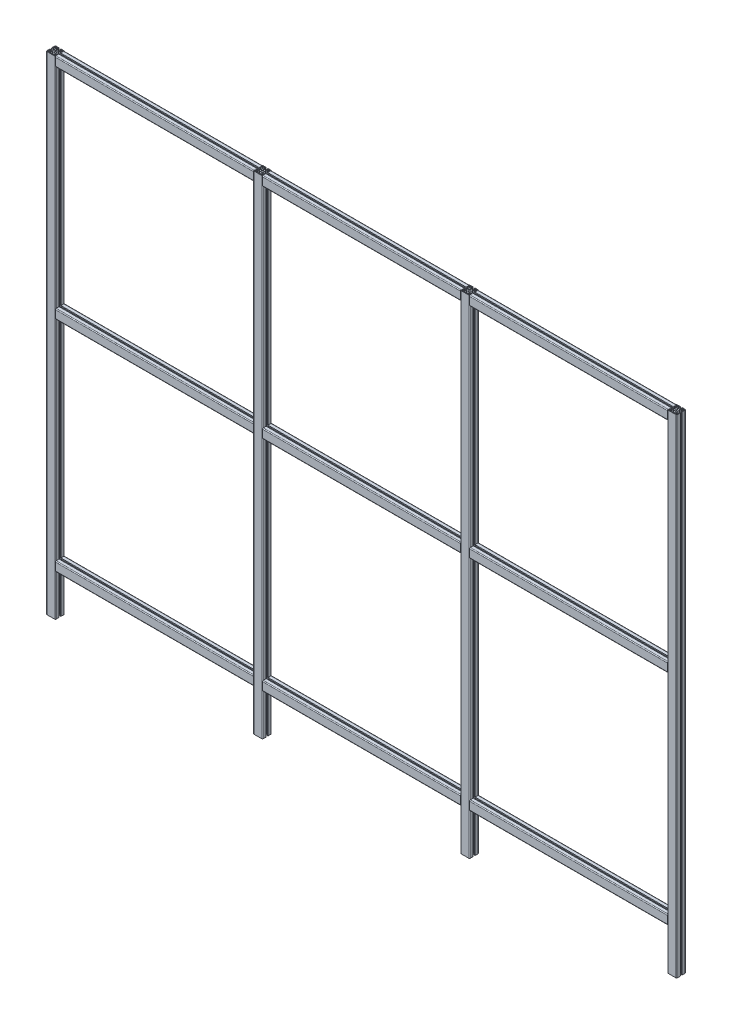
from build123d import *

# Parameters (mm, degrees)
CLOSED_PROFILES_40_LIGHT_SP5510N_PROFILE_DEPTH      = 2100
CLOSED_PROFILES_40_LIGHT_SP5510N_PROFILE_DEPTH_BACK = 20
SKETCH13_R                                          = 3.4
SKETCH13_ON_SEGMENT_2_R                             = 3.4
CLOSED_PROFILES_40_LIGHT_SP5510N_PRO_2_DEPTH        = 2120
SKETCH13_ON_SEGMENT_3_R                             = 3.4
CLOSED_PROFILES_40_LIGHT_SP5510N_PRO_3_DEPTH        = 2120
SKETCH13_ON_SEGMENT_4_R                             = 3.4
CLOSED_PROFILES_40_LIGHT_SP5510N_PRO_4_DEPTH        = 2120
SKETCH13_ON_SEGMENT_5_R                             = 3.4
CLOSED_PROFILES_40_LIGHT_SP5510N_PRO_5_DEPTH        = 902
SKETCH13_ON_SEGMENT_6_R                             = 3.4
CLOSED_PROFILES_40_LIGHT_SP5510N_PRO_7_DEPTH        = 902
SKETCH13_ON_SEGMENT_7_R                             = 3.4
CLOSED_PROFILES_40_LIGHT_SP5510N_PRO_9_DEPTH        = 902
SKETCH13_ON_SEGMENT_8_R                             = 3.4
CLOSED_PROFILES_40_LIGHT_SP5510N_PRO_11_DEPTH       = 902
SKETCH13_ON_SEGMENT_9_R                             = 3.4
CLOSED_PROFILES_40_LIGHT_SP5510N_PRO_14_DEPTH       = 902
SKETCH13_ON_SEGMENT_10_R                            = 3.4
CLOSED_PROFILES_40_LIGHT_SP5510N_PRO_17_DEPTH       = 902
SKETCH13_ON_SEGMENT_11_R                            = 3.4
CLOSED_PROFILES_40_LIGHT_SP5510N_PRO_20_DEPTH       = 902
SKETCH13_ON_SEGMENT_12_R                            = 3.4
CLOSED_PROFILES_40_LIGHT_SP5510N_PRO_23_DEPTH       = 902
SKETCH13_ON_SEGMENT_13_R                            = 3.4
CLOSED_PROFILES_40_LIGHT_SP5510N_PRO_26_DEPTH       = 902


with BuildPart() as part:
    # Sketch13 → Closed profiles 40 light SP5510N PROFILE (new, two sides: drawn at the far end of the back side and taken through both)
    with BuildSketch(Plane(origin=(-1350, 0, 0), x_dir=(0, 0, -1), z_dir=(0, -1, 0)).offset(-CLOSED_PROFILES_40_LIGHT_SP5510N_PROFILE_DEPTH_BACK)):
        with BuildLine():
            Line((15.5, 4.1), (20, 4.1))
            Line((20, 4.1), (20, 16.5))
            ThreePointArc((20, 16.5), (18.974873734, 18.974873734), (16.5, 20))
            Line((16.5, 20), (4.1, 20))
            Line((4.1, 20), (4.1, 15.5))
            Line((4.1, 15.5), (6, 15.5))
            Line((6, 15.5), (6, 18))
            Line((6, 18), (10, 18))
            Line((10, 18), (10, 12.121))
            Line((10, 12.121), (5.479, 7.6))
            Line((5.479, 7.6), (-5.479, 7.6))
            Line((-5.479, 7.6), (-10, 12.121))
            Line((-10, 12.121), (-10, 18))
            Line((-10, 18), (-6, 18))
            Line((-6, 18), (-6, 15.5))
            Line((-6, 15.5), (-4.1, 15.5))
            Line((-4.1, 15.5), (-4.1, 20))
            Line((-4.1, 20), (-16.5, 20))
            ThreePointArc((-16.5, 20), (-18.974873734, 18.974873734), (-20, 16.5))
            Line((-20, 16.5), (-20, -16.5))
            ThreePointArc((-20, -16.5), (-18.974873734, -18.974873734), (-16.5, -20))
            Line((-16.5, -20), (-4.1, -20))
            Line((-4.1, -20), (-4.1, -15.5))
            Line((-4.1, -15.5), (-6, -15.5))
            Line((-6, -15.5), (-6, -18))
            Line((-6, -18), (-10, -18))
            Line((-10, -18), (-10, -12.121))
            Line((-10, -12.121), (-5.479, -7.6))
            Line((-5.479, -7.6), (5.479, -7.6))
            Line((5.479, -7.6), (10, -12.121))
            Line((10, -12.121), (10, -18))
            Line((10, -18), (6, -18))
            Line((6, -18), (6, -15.5))
            Line((6, -15.5), (4.1, -15.5))
            Line((4.1, -15.5), (4.1, -20))
            Line((4.1, -20), (16.5, -20))
            ThreePointArc((16.5, -20), (18.974873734, -18.974873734), (20, -16.5))
            Line((20, -16.5), (20, -4.1))
            Line((20, -4.1), (15.5, -4.1))
            Line((15.5, -4.1), (15.5, -6))
            Line((15.5, -6), (18, -6))
            Line((18, -6), (18, -10))
            Line((18, -10), (12.121, -10))
            Line((12.121, -10), (7.6, -5.479))
            Line((7.6, -5.479), (7.6, 5.479))
            Line((7.6, 5.479), (12.121, 10))
            Line((12.121, 10), (18, 10))
            Line((18, 10), (18, 6))
            Line((18, 6), (15.5, 6))
            Line((15.5, 6), (15.5, 4.1))
        make_face()
        Circle(SKETCH13_R, mode=Mode.SUBTRACT)
        with BuildLine():
            Line((17.1, -11.7), (12.7, -11.7))
            ThreePointArc((12.7, -11.7), (11.992893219, -11.992893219), (11.7, -12.7))
            Line((11.7, -12.7), (11.7, -17.1))
            ThreePointArc((11.7, -17.1), (11.992893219, -17.807106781), (12.7, -18.1))
            Line((12.7, -18.1), (15.6, -18.1))
            ThreePointArc((15.6, -18.1), (17.367766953, -17.367766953), (18.1, -15.6))
            Line((18.1, -15.6), (18.1, -12.7))
            ThreePointArc((18.1, -12.7), (17.807106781, -11.992893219), (17.1, -11.7))
        make_face(mode=Mode.SUBTRACT)
        with BuildLine():
            Line((-11.7, -17.1), (-11.7, -12.7))
            ThreePointArc((-11.7, -12.7), (-11.992893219, -11.992893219), (-12.7, -11.7))
            Line((-12.7, -11.7), (-17.1, -11.7))
            ThreePointArc((-17.1, -11.7), (-17.807106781, -11.992893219), (-18.1, -12.7))
            Line((-18.1, -12.7), (-18.1, -15.6))
            ThreePointArc((-18.1, -15.6), (-17.367766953, -17.367766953), (-15.6, -18.1))
            Line((-15.6, -18.1), (-12.7, -18.1))
            ThreePointArc((-12.7, -18.1), (-11.992893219, -17.807106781), (-11.7, -17.1))
        make_face(mode=Mode.SUBTRACT)
        with BuildLine():
            Line((-17.1, 11.7), (-12.7, 11.7))
            ThreePointArc((-12.7, 11.7), (-11.992893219, 11.992893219), (-11.7, 12.7))
            Line((-11.7, 12.7), (-11.7, 17.1))
            ThreePointArc((-11.7, 17.1), (-11.992893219, 17.807106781), (-12.7, 18.1))
            Line((-12.7, 18.1), (-15.6, 18.1))
            ThreePointArc((-15.6, 18.1), (-17.367766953, 17.367766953), (-18.1, 15.6))
            Line((-18.1, 15.6), (-18.1, 12.7))
            ThreePointArc((-18.1, 12.7), (-17.807106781, 11.992893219), (-17.1, 11.7))
        make_face(mode=Mode.SUBTRACT)
        with BuildLine():
            Line((11.7, 17.1), (11.7, 12.7))
            ThreePointArc((11.7, 12.7), (11.992893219, 11.992893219), (12.7, 11.7))
            Line((12.7, 11.7), (17.1, 11.7))
            ThreePointArc((17.1, 11.7), (17.807106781, 11.992893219), (18.1, 12.7))
            Line((18.1, 12.7), (18.1, 15.6))
            ThreePointArc((18.1, 15.6), (17.367766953, 17.367766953), (15.6, 18.1))
            Line((15.6, 18.1), (12.7, 18.1))
            ThreePointArc((12.7, 18.1), (11.992893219, 17.807106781), (11.7, 17.1))
        make_face(mode=Mode.SUBTRACT)
        Polygon((-18, -4.1), (-15.5, -4.1), (-15.5, -6), (-18, -6), (-18, -10), (-12.121, -10), (-7.6, -5.479), (-7.6, 5.479), (-12.121, 10), (-18, 10), (-18, 6), (-15.5, 6), (-15.5, 4.1), (-18, 4.1), align=None, mode=Mode.SUBTRACT)
    extrude(amount=CLOSED_PROFILES_40_LIGHT_SP5510N_PROFILE_DEPTH + CLOSED_PROFILES_40_LIGHT_SP5510N_PROFILE_DEPTH_BACK)


with BuildPart() as body_2:
    # Sketch13 on segment 2 (on carried to segment 2) → Closed profiles 40 light SP5510N PRO 2 (new body)
    with BuildSketch(Plane(origin=(-450, 20, 0), x_dir=(0, 0, -1), z_dir=(0, -1, 0))):
        with BuildLine():
            Line((15.5, 4.1), (20, 4.1))
            Line((20, 4.1), (20, 16.5))
            ThreePointArc((20, 16.5), (18.974873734, 18.974873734), (16.5, 20))
            Line((16.5, 20), (4.1, 20))
            Line((4.1, 20), (4.1, 15.5))
            Line((4.1, 15.5), (6, 15.5))
            Line((6, 15.5), (6, 18))
            Line((6, 18), (10, 18))
            Line((10, 18), (10, 12.121))
            Line((10, 12.121), (5.479, 7.6))
            Line((5.479, 7.6), (-5.479, 7.6))
            Line((-5.479, 7.6), (-10, 12.121))
            Line((-10, 12.121), (-10, 18))
            Line((-10, 18), (-6, 18))
            Line((-6, 18), (-6, 15.5))
            Line((-6, 15.5), (-4.1, 15.5))
            Line((-4.1, 15.5), (-4.1, 20))
            Line((-4.1, 20), (-16.5, 20))
            ThreePointArc((-16.5, 20), (-18.974873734, 18.974873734), (-20, 16.5))
            Line((-20, 16.5), (-20, -16.5))
            ThreePointArc((-20, -16.5), (-18.974873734, -18.974873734), (-16.5, -20))
            Line((-16.5, -20), (-4.1, -20))
            Line((-4.1, -20), (-4.1, -15.5))
            Line((-4.1, -15.5), (-6, -15.5))
            Line((-6, -15.5), (-6, -18))
            Line((-6, -18), (-10, -18))
            Line((-10, -18), (-10, -12.121))
            Line((-10, -12.121), (-5.479, -7.6))
            Line((-5.479, -7.6), (5.479, -7.6))
            Line((5.479, -7.6), (10, -12.121))
            Line((10, -12.121), (10, -18))
            Line((10, -18), (6, -18))
            Line((6, -18), (6, -15.5))
            Line((6, -15.5), (4.1, -15.5))
            Line((4.1, -15.5), (4.1, -20))
            Line((4.1, -20), (16.5, -20))
            ThreePointArc((16.5, -20), (18.974873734, -18.974873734), (20, -16.5))
            Line((20, -16.5), (20, -4.1))
            Line((20, -4.1), (15.5, -4.1))
            Line((15.5, -4.1), (15.5, -6))
            Line((15.5, -6), (18, -6))
            Line((18, -6), (18, -10))
            Line((18, -10), (12.121, -10))
            Line((12.121, -10), (7.6, -5.479))
            Line((7.6, -5.479), (7.6, 5.479))
            Line((7.6, 5.479), (12.121, 10))
            Line((12.121, 10), (18, 10))
            Line((18, 10), (18, 6))
            Line((18, 6), (15.5, 6))
            Line((15.5, 6), (15.5, 4.1))
        make_face()
        Circle(SKETCH13_ON_SEGMENT_2_R, mode=Mode.SUBTRACT)
        with BuildLine():
            Line((17.1, -11.7), (12.7, -11.7))
            ThreePointArc((12.7, -11.7), (11.992893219, -11.992893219), (11.7, -12.7))
            Line((11.7, -12.7), (11.7, -17.1))
            ThreePointArc((11.7, -17.1), (11.992893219, -17.807106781), (12.7, -18.1))
            Line((12.7, -18.1), (15.6, -18.1))
            ThreePointArc((15.6, -18.1), (17.367766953, -17.367766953), (18.1, -15.6))
            Line((18.1, -15.6), (18.1, -12.7))
            ThreePointArc((18.1, -12.7), (17.807106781, -11.992893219), (17.1, -11.7))
        make_face(mode=Mode.SUBTRACT)
        with BuildLine():
            Line((-11.7, -17.1), (-11.7, -12.7))
            ThreePointArc((-11.7, -12.7), (-11.992893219, -11.992893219), (-12.7, -11.7))
            Line((-12.7, -11.7), (-17.1, -11.7))
            ThreePointArc((-17.1, -11.7), (-17.807106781, -11.992893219), (-18.1, -12.7))
            Line((-18.1, -12.7), (-18.1, -15.6))
            ThreePointArc((-18.1, -15.6), (-17.367766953, -17.367766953), (-15.6, -18.1))
            Line((-15.6, -18.1), (-12.7, -18.1))
            ThreePointArc((-12.7, -18.1), (-11.992893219, -17.807106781), (-11.7, -17.1))
        make_face(mode=Mode.SUBTRACT)
        with BuildLine():
            Line((-17.1, 11.7), (-12.7, 11.7))
            ThreePointArc((-12.7, 11.7), (-11.992893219, 11.992893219), (-11.7, 12.7))
            Line((-11.7, 12.7), (-11.7, 17.1))
            ThreePointArc((-11.7, 17.1), (-11.992893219, 17.807106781), (-12.7, 18.1))
            Line((-12.7, 18.1), (-15.6, 18.1))
            ThreePointArc((-15.6, 18.1), (-17.367766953, 17.367766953), (-18.1, 15.6))
            Line((-18.1, 15.6), (-18.1, 12.7))
            ThreePointArc((-18.1, 12.7), (-17.807106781, 11.992893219), (-17.1, 11.7))
        make_face(mode=Mode.SUBTRACT)
        with BuildLine():
            Line((11.7, 17.1), (11.7, 12.7))
            ThreePointArc((11.7, 12.7), (11.992893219, 11.992893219), (12.7, 11.7))
            Line((12.7, 11.7), (17.1, 11.7))
            ThreePointArc((17.1, 11.7), (17.807106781, 11.992893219), (18.1, 12.7))
            Line((18.1, 12.7), (18.1, 15.6))
            ThreePointArc((18.1, 15.6), (17.367766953, 17.367766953), (15.6, 18.1))
            Line((15.6, 18.1), (12.7, 18.1))
            ThreePointArc((12.7, 18.1), (11.992893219, 17.807106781), (11.7, 17.1))
        make_face(mode=Mode.SUBTRACT)
        Polygon((-18, -4.1), (-15.5, -4.1), (-15.5, -6), (-18, -6), (-18, -10), (-12.121, -10), (-7.6, -5.479), (-7.6, 5.479), (-12.121, 10), (-18, 10), (-18, 6), (-15.5, 6), (-15.5, 4.1), (-18, 4.1), align=None, mode=Mode.SUBTRACT)
    extrude(amount=CLOSED_PROFILES_40_LIGHT_SP5510N_PRO_2_DEPTH)


with BuildPart() as body_3:
    # Sketch13 on segment 3 (on carried to segment 3) → Closed profiles 40 light SP5510N PRO 3 (new body)
    with BuildSketch(Plane(origin=(450, 20, 0), x_dir=(0, 0, -1), z_dir=(0, -1, 0))):
        with BuildLine():
            Line((15.5, 4.1), (20, 4.1))
            Line((20, 4.1), (20, 16.5))
            ThreePointArc((20, 16.5), (18.974873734, 18.974873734), (16.5, 20))
            Line((16.5, 20), (4.1, 20))
            Line((4.1, 20), (4.1, 15.5))
            Line((4.1, 15.5), (6, 15.5))
            Line((6, 15.5), (6, 18))
            Line((6, 18), (10, 18))
            Line((10, 18), (10, 12.121))
            Line((10, 12.121), (5.479, 7.6))
            Line((5.479, 7.6), (-5.479, 7.6))
            Line((-5.479, 7.6), (-10, 12.121))
            Line((-10, 12.121), (-10, 18))
            Line((-10, 18), (-6, 18))
            Line((-6, 18), (-6, 15.5))
            Line((-6, 15.5), (-4.1, 15.5))
            Line((-4.1, 15.5), (-4.1, 20))
            Line((-4.1, 20), (-16.5, 20))
            ThreePointArc((-16.5, 20), (-18.974873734, 18.974873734), (-20, 16.5))
            Line((-20, 16.5), (-20, -16.5))
            ThreePointArc((-20, -16.5), (-18.974873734, -18.974873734), (-16.5, -20))
            Line((-16.5, -20), (-4.1, -20))
            Line((-4.1, -20), (-4.1, -15.5))
            Line((-4.1, -15.5), (-6, -15.5))
            Line((-6, -15.5), (-6, -18))
            Line((-6, -18), (-10, -18))
            Line((-10, -18), (-10, -12.121))
            Line((-10, -12.121), (-5.479, -7.6))
            Line((-5.479, -7.6), (5.479, -7.6))
            Line((5.479, -7.6), (10, -12.121))
            Line((10, -12.121), (10, -18))
            Line((10, -18), (6, -18))
            Line((6, -18), (6, -15.5))
            Line((6, -15.5), (4.1, -15.5))
            Line((4.1, -15.5), (4.1, -20))
            Line((4.1, -20), (16.5, -20))
            ThreePointArc((16.5, -20), (18.974873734, -18.974873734), (20, -16.5))
            Line((20, -16.5), (20, -4.1))
            Line((20, -4.1), (15.5, -4.1))
            Line((15.5, -4.1), (15.5, -6))
            Line((15.5, -6), (18, -6))
            Line((18, -6), (18, -10))
            Line((18, -10), (12.121, -10))
            Line((12.121, -10), (7.6, -5.479))
            Line((7.6, -5.479), (7.6, 5.479))
            Line((7.6, 5.479), (12.121, 10))
            Line((12.121, 10), (18, 10))
            Line((18, 10), (18, 6))
            Line((18, 6), (15.5, 6))
            Line((15.5, 6), (15.5, 4.1))
        make_face()
        Circle(SKETCH13_ON_SEGMENT_3_R, mode=Mode.SUBTRACT)
        with BuildLine():
            Line((17.1, -11.7), (12.7, -11.7))
            ThreePointArc((12.7, -11.7), (11.992893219, -11.992893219), (11.7, -12.7))
            Line((11.7, -12.7), (11.7, -17.1))
            ThreePointArc((11.7, -17.1), (11.992893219, -17.807106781), (12.7, -18.1))
            Line((12.7, -18.1), (15.6, -18.1))
            ThreePointArc((15.6, -18.1), (17.367766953, -17.367766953), (18.1, -15.6))
            Line((18.1, -15.6), (18.1, -12.7))
            ThreePointArc((18.1, -12.7), (17.807106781, -11.992893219), (17.1, -11.7))
        make_face(mode=Mode.SUBTRACT)
        with BuildLine():
            Line((-11.7, -17.1), (-11.7, -12.7))
            ThreePointArc((-11.7, -12.7), (-11.992893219, -11.992893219), (-12.7, -11.7))
            Line((-12.7, -11.7), (-17.1, -11.7))
            ThreePointArc((-17.1, -11.7), (-17.807106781, -11.992893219), (-18.1, -12.7))
            Line((-18.1, -12.7), (-18.1, -15.6))
            ThreePointArc((-18.1, -15.6), (-17.367766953, -17.367766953), (-15.6, -18.1))
            Line((-15.6, -18.1), (-12.7, -18.1))
            ThreePointArc((-12.7, -18.1), (-11.992893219, -17.807106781), (-11.7, -17.1))
        make_face(mode=Mode.SUBTRACT)
        with BuildLine():
            Line((-17.1, 11.7), (-12.7, 11.7))
            ThreePointArc((-12.7, 11.7), (-11.992893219, 11.992893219), (-11.7, 12.7))
            Line((-11.7, 12.7), (-11.7, 17.1))
            ThreePointArc((-11.7, 17.1), (-11.992893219, 17.807106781), (-12.7, 18.1))
            Line((-12.7, 18.1), (-15.6, 18.1))
            ThreePointArc((-15.6, 18.1), (-17.367766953, 17.367766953), (-18.1, 15.6))
            Line((-18.1, 15.6), (-18.1, 12.7))
            ThreePointArc((-18.1, 12.7), (-17.807106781, 11.992893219), (-17.1, 11.7))
        make_face(mode=Mode.SUBTRACT)
        with BuildLine():
            Line((11.7, 17.1), (11.7, 12.7))
            ThreePointArc((11.7, 12.7), (11.992893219, 11.992893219), (12.7, 11.7))
            Line((12.7, 11.7), (17.1, 11.7))
            ThreePointArc((17.1, 11.7), (17.807106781, 11.992893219), (18.1, 12.7))
            Line((18.1, 12.7), (18.1, 15.6))
            ThreePointArc((18.1, 15.6), (17.367766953, 17.367766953), (15.6, 18.1))
            Line((15.6, 18.1), (12.7, 18.1))
            ThreePointArc((12.7, 18.1), (11.992893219, 17.807106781), (11.7, 17.1))
        make_face(mode=Mode.SUBTRACT)
        Polygon((-18, -4.1), (-15.5, -4.1), (-15.5, -6), (-18, -6), (-18, -10), (-12.121, -10), (-7.6, -5.479), (-7.6, 5.479), (-12.121, 10), (-18, 10), (-18, 6), (-15.5, 6), (-15.5, 4.1), (-18, 4.1), align=None, mode=Mode.SUBTRACT)
    extrude(amount=CLOSED_PROFILES_40_LIGHT_SP5510N_PRO_3_DEPTH)


with BuildPart() as body_4:
    # Sketch13 on segment 4 (on carried to segment 4) → Closed profiles 40 light SP5510N PRO 4 (new body)
    with BuildSketch(Plane(origin=(1350, 20, 0), x_dir=(0, 0, -1), z_dir=(0, -1, 0))):
        with BuildLine():
            Line((15.5, 4.1), (20, 4.1))
            Line((20, 4.1), (20, 16.5))
            ThreePointArc((20, 16.5), (18.974873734, 18.974873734), (16.5, 20))
            Line((16.5, 20), (4.1, 20))
            Line((4.1, 20), (4.1, 15.5))
            Line((4.1, 15.5), (6, 15.5))
            Line((6, 15.5), (6, 18))
            Line((6, 18), (10, 18))
            Line((10, 18), (10, 12.121))
            Line((10, 12.121), (5.479, 7.6))
            Line((5.479, 7.6), (-5.479, 7.6))
            Line((-5.479, 7.6), (-10, 12.121))
            Line((-10, 12.121), (-10, 18))
            Line((-10, 18), (-6, 18))
            Line((-6, 18), (-6, 15.5))
            Line((-6, 15.5), (-4.1, 15.5))
            Line((-4.1, 15.5), (-4.1, 20))
            Line((-4.1, 20), (-16.5, 20))
            ThreePointArc((-16.5, 20), (-18.974873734, 18.974873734), (-20, 16.5))
            Line((-20, 16.5), (-20, -16.5))
            ThreePointArc((-20, -16.5), (-18.974873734, -18.974873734), (-16.5, -20))
            Line((-16.5, -20), (-4.1, -20))
            Line((-4.1, -20), (-4.1, -15.5))
            Line((-4.1, -15.5), (-6, -15.5))
            Line((-6, -15.5), (-6, -18))
            Line((-6, -18), (-10, -18))
            Line((-10, -18), (-10, -12.121))
            Line((-10, -12.121), (-5.479, -7.6))
            Line((-5.479, -7.6), (5.479, -7.6))
            Line((5.479, -7.6), (10, -12.121))
            Line((10, -12.121), (10, -18))
            Line((10, -18), (6, -18))
            Line((6, -18), (6, -15.5))
            Line((6, -15.5), (4.1, -15.5))
            Line((4.1, -15.5), (4.1, -20))
            Line((4.1, -20), (16.5, -20))
            ThreePointArc((16.5, -20), (18.974873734, -18.974873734), (20, -16.5))
            Line((20, -16.5), (20, -4.1))
            Line((20, -4.1), (15.5, -4.1))
            Line((15.5, -4.1), (15.5, -6))
            Line((15.5, -6), (18, -6))
            Line((18, -6), (18, -10))
            Line((18, -10), (12.121, -10))
            Line((12.121, -10), (7.6, -5.479))
            Line((7.6, -5.479), (7.6, 5.479))
            Line((7.6, 5.479), (12.121, 10))
            Line((12.121, 10), (18, 10))
            Line((18, 10), (18, 6))
            Line((18, 6), (15.5, 6))
            Line((15.5, 6), (15.5, 4.1))
        make_face()
        Circle(SKETCH13_ON_SEGMENT_4_R, mode=Mode.SUBTRACT)
        with BuildLine():
            Line((17.1, -11.7), (12.7, -11.7))
            ThreePointArc((12.7, -11.7), (11.992893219, -11.992893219), (11.7, -12.7))
            Line((11.7, -12.7), (11.7, -17.1))
            ThreePointArc((11.7, -17.1), (11.992893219, -17.807106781), (12.7, -18.1))
            Line((12.7, -18.1), (15.6, -18.1))
            ThreePointArc((15.6, -18.1), (17.367766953, -17.367766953), (18.1, -15.6))
            Line((18.1, -15.6), (18.1, -12.7))
            ThreePointArc((18.1, -12.7), (17.807106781, -11.992893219), (17.1, -11.7))
        make_face(mode=Mode.SUBTRACT)
        with BuildLine():
            Line((-11.7, -17.1), (-11.7, -12.7))
            ThreePointArc((-11.7, -12.7), (-11.992893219, -11.992893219), (-12.7, -11.7))
            Line((-12.7, -11.7), (-17.1, -11.7))
            ThreePointArc((-17.1, -11.7), (-17.807106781, -11.992893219), (-18.1, -12.7))
            Line((-18.1, -12.7), (-18.1, -15.6))
            ThreePointArc((-18.1, -15.6), (-17.367766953, -17.367766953), (-15.6, -18.1))
            Line((-15.6, -18.1), (-12.7, -18.1))
            ThreePointArc((-12.7, -18.1), (-11.992893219, -17.807106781), (-11.7, -17.1))
        make_face(mode=Mode.SUBTRACT)
        with BuildLine():
            Line((-17.1, 11.7), (-12.7, 11.7))
            ThreePointArc((-12.7, 11.7), (-11.992893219, 11.992893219), (-11.7, 12.7))
            Line((-11.7, 12.7), (-11.7, 17.1))
            ThreePointArc((-11.7, 17.1), (-11.992893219, 17.807106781), (-12.7, 18.1))
            Line((-12.7, 18.1), (-15.6, 18.1))
            ThreePointArc((-15.6, 18.1), (-17.367766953, 17.367766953), (-18.1, 15.6))
            Line((-18.1, 15.6), (-18.1, 12.7))
            ThreePointArc((-18.1, 12.7), (-17.807106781, 11.992893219), (-17.1, 11.7))
        make_face(mode=Mode.SUBTRACT)
        with BuildLine():
            Line((11.7, 17.1), (11.7, 12.7))
            ThreePointArc((11.7, 12.7), (11.992893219, 11.992893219), (12.7, 11.7))
            Line((12.7, 11.7), (17.1, 11.7))
            ThreePointArc((17.1, 11.7), (17.807106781, 11.992893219), (18.1, 12.7))
            Line((18.1, 12.7), (18.1, 15.6))
            ThreePointArc((18.1, 15.6), (17.367766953, 17.367766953), (15.6, 18.1))
            Line((15.6, 18.1), (12.7, 18.1))
            ThreePointArc((12.7, 18.1), (11.992893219, 17.807106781), (11.7, 17.1))
        make_face(mode=Mode.SUBTRACT)
        Polygon((-18, -4.1), (-15.5, -4.1), (-15.5, -6), (-18, -6), (-18, -10), (-12.121, -10), (-7.6, -5.479), (-7.6, 5.479), (-12.121, 10), (-18, 10), (-18, 6), (-15.5, 6), (-15.5, 4.1), (-18, 4.1), align=None, mode=Mode.SUBTRACT)
    extrude(amount=CLOSED_PROFILES_40_LIGHT_SP5510N_PRO_4_DEPTH)


with BuildPart() as body_5:
    # Sketch13 on segment 5 (on carried to segment 5) → Closed profiles 40 light SP5510N PRO 5 (new body)
    with BuildSketch(Plane(origin=(-1351, 0, 0), x_dir=(0, 0, -1), z_dir=(1, 0, 0))):
        with BuildLine():
            Line((15.5, 4.1), (20, 4.1))
            Line((20, 4.1), (20, 16.5))
            ThreePointArc((20, 16.5), (18.974873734, 18.974873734), (16.5, 20))
            Line((16.5, 20), (4.1, 20))
            Line((4.1, 20), (4.1, 15.5))
            Line((4.1, 15.5), (6, 15.5))
            Line((6, 15.5), (6, 18))
            Line((6, 18), (10, 18))
            Line((10, 18), (10, 12.121))
            Line((10, 12.121), (5.479, 7.6))
            Line((5.479, 7.6), (-5.479, 7.6))
            Line((-5.479, 7.6), (-10, 12.121))
            Line((-10, 12.121), (-10, 18))
            Line((-10, 18), (-6, 18))
            Line((-6, 18), (-6, 15.5))
            Line((-6, 15.5), (-4.1, 15.5))
            Line((-4.1, 15.5), (-4.1, 20))
            Line((-4.1, 20), (-16.5, 20))
            ThreePointArc((-16.5, 20), (-18.974873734, 18.974873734), (-20, 16.5))
            Line((-20, 16.5), (-20, -16.5))
            ThreePointArc((-20, -16.5), (-18.974873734, -18.974873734), (-16.5, -20))
            Line((-16.5, -20), (-4.1, -20))
            Line((-4.1, -20), (-4.1, -15.5))
            Line((-4.1, -15.5), (-6, -15.5))
            Line((-6, -15.5), (-6, -18))
            Line((-6, -18), (-10, -18))
            Line((-10, -18), (-10, -12.121))
            Line((-10, -12.121), (-5.479, -7.6))
            Line((-5.479, -7.6), (5.479, -7.6))
            Line((5.479, -7.6), (10, -12.121))
            Line((10, -12.121), (10, -18))
            Line((10, -18), (6, -18))
            Line((6, -18), (6, -15.5))
            Line((6, -15.5), (4.1, -15.5))
            Line((4.1, -15.5), (4.1, -20))
            Line((4.1, -20), (16.5, -20))
            ThreePointArc((16.5, -20), (18.974873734, -18.974873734), (20, -16.5))
            Line((20, -16.5), (20, -4.1))
            Line((20, -4.1), (15.5, -4.1))
            Line((15.5, -4.1), (15.5, -6))
            Line((15.5, -6), (18, -6))
            Line((18, -6), (18, -10))
            Line((18, -10), (12.121, -10))
            Line((12.121, -10), (7.6, -5.479))
            Line((7.6, -5.479), (7.6, 5.479))
            Line((7.6, 5.479), (12.121, 10))
            Line((12.121, 10), (18, 10))
            Line((18, 10), (18, 6))
            Line((18, 6), (15.5, 6))
            Line((15.5, 6), (15.5, 4.1))
        make_face()
        Circle(SKETCH13_ON_SEGMENT_5_R, mode=Mode.SUBTRACT)
        with BuildLine():
            Line((17.1, -11.7), (12.7, -11.7))
            ThreePointArc((12.7, -11.7), (11.992893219, -11.992893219), (11.7, -12.7))
            Line((11.7, -12.7), (11.7, -17.1))
            ThreePointArc((11.7, -17.1), (11.992893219, -17.807106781), (12.7, -18.1))
            Line((12.7, -18.1), (15.6, -18.1))
            ThreePointArc((15.6, -18.1), (17.367766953, -17.367766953), (18.1, -15.6))
            Line((18.1, -15.6), (18.1, -12.7))
            ThreePointArc((18.1, -12.7), (17.807106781, -11.992893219), (17.1, -11.7))
        make_face(mode=Mode.SUBTRACT)
        with BuildLine():
            Line((-11.7, -17.1), (-11.7, -12.7))
            ThreePointArc((-11.7, -12.7), (-11.992893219, -11.992893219), (-12.7, -11.7))
            Line((-12.7, -11.7), (-17.1, -11.7))
            ThreePointArc((-17.1, -11.7), (-17.807106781, -11.992893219), (-18.1, -12.7))
            Line((-18.1, -12.7), (-18.1, -15.6))
            ThreePointArc((-18.1, -15.6), (-17.367766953, -17.367766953), (-15.6, -18.1))
            Line((-15.6, -18.1), (-12.7, -18.1))
            ThreePointArc((-12.7, -18.1), (-11.992893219, -17.807106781), (-11.7, -17.1))
        make_face(mode=Mode.SUBTRACT)
        with BuildLine():
            Line((-17.1, 11.7), (-12.7, 11.7))
            ThreePointArc((-12.7, 11.7), (-11.992893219, 11.992893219), (-11.7, 12.7))
            Line((-11.7, 12.7), (-11.7, 17.1))
            ThreePointArc((-11.7, 17.1), (-11.992893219, 17.807106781), (-12.7, 18.1))
            Line((-12.7, 18.1), (-15.6, 18.1))
            ThreePointArc((-15.6, 18.1), (-17.367766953, 17.367766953), (-18.1, 15.6))
            Line((-18.1, 15.6), (-18.1, 12.7))
            ThreePointArc((-18.1, 12.7), (-17.807106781, 11.992893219), (-17.1, 11.7))
        make_face(mode=Mode.SUBTRACT)
        with BuildLine():
            Line((11.7, 17.1), (11.7, 12.7))
            ThreePointArc((11.7, 12.7), (11.992893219, 11.992893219), (12.7, 11.7))
            Line((12.7, 11.7), (17.1, 11.7))
            ThreePointArc((17.1, 11.7), (17.807106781, 11.992893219), (18.1, 12.7))
            Line((18.1, 12.7), (18.1, 15.6))
            ThreePointArc((18.1, 15.6), (17.367766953, 17.367766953), (15.6, 18.1))
            Line((15.6, 18.1), (12.7, 18.1))
            ThreePointArc((12.7, 18.1), (11.992893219, 17.807106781), (11.7, 17.1))
        make_face(mode=Mode.SUBTRACT)
        Polygon((-18, -4.1), (-15.5, -4.1), (-15.5, -6), (-18, -6), (-18, -10), (-12.121, -10), (-7.6, -5.479), (-7.6, 5.479), (-12.121, 10), (-18, 10), (-18, 6), (-15.5, 6), (-15.5, 4.1), (-18, 4.1), align=None, mode=Mode.SUBTRACT)
    extrude(amount=CLOSED_PROFILES_40_LIGHT_SP5510N_PRO_5_DEPTH)

    # Closed profiles 40 light SP5510N PRO 5 e
    split(bisect_by=Plane.YZ.offset(-1330), keep=Keep.TOP)

    # Closed profiles 40 light SP5510N PRO 6
    split(bisect_by=Plane(origin=(-470, 0, 0), x_dir=(0, -1, 0), z_dir=(-1, 0, 0)), keep=Keep.TOP)


with BuildPart() as body_6:
    # Sketch13 on segment 6 (on carried to segment 6) → Closed profiles 40 light SP5510N PRO 7 (new body)
    with BuildSketch(Plane(origin=(-1351, -1900, 0), x_dir=(0, 0, -1), z_dir=(1, 0, 0))):
        with BuildLine():
            Line((15.5, 4.1), (20, 4.1))
            Line((20, 4.1), (20, 16.5))
            ThreePointArc((20, 16.5), (18.974873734, 18.974873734), (16.5, 20))
            Line((16.5, 20), (4.1, 20))
            Line((4.1, 20), (4.1, 15.5))
            Line((4.1, 15.5), (6, 15.5))
            Line((6, 15.5), (6, 18))
            Line((6, 18), (10, 18))
            Line((10, 18), (10, 12.121))
            Line((10, 12.121), (5.479, 7.6))
            Line((5.479, 7.6), (-5.479, 7.6))
            Line((-5.479, 7.6), (-10, 12.121))
            Line((-10, 12.121), (-10, 18))
            Line((-10, 18), (-6, 18))
            Line((-6, 18), (-6, 15.5))
            Line((-6, 15.5), (-4.1, 15.5))
            Line((-4.1, 15.5), (-4.1, 20))
            Line((-4.1, 20), (-16.5, 20))
            ThreePointArc((-16.5, 20), (-18.974873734, 18.974873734), (-20, 16.5))
            Line((-20, 16.5), (-20, -16.5))
            ThreePointArc((-20, -16.5), (-18.974873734, -18.974873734), (-16.5, -20))
            Line((-16.5, -20), (-4.1, -20))
            Line((-4.1, -20), (-4.1, -15.5))
            Line((-4.1, -15.5), (-6, -15.5))
            Line((-6, -15.5), (-6, -18))
            Line((-6, -18), (-10, -18))
            Line((-10, -18), (-10, -12.121))
            Line((-10, -12.121), (-5.479, -7.6))
            Line((-5.479, -7.6), (5.479, -7.6))
            Line((5.479, -7.6), (10, -12.121))
            Line((10, -12.121), (10, -18))
            Line((10, -18), (6, -18))
            Line((6, -18), (6, -15.5))
            Line((6, -15.5), (4.1, -15.5))
            Line((4.1, -15.5), (4.1, -20))
            Line((4.1, -20), (16.5, -20))
            ThreePointArc((16.5, -20), (18.974873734, -18.974873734), (20, -16.5))
            Line((20, -16.5), (20, -4.1))
            Line((20, -4.1), (15.5, -4.1))
            Line((15.5, -4.1), (15.5, -6))
            Line((15.5, -6), (18, -6))
            Line((18, -6), (18, -10))
            Line((18, -10), (12.121, -10))
            Line((12.121, -10), (7.6, -5.479))
            Line((7.6, -5.479), (7.6, 5.479))
            Line((7.6, 5.479), (12.121, 10))
            Line((12.121, 10), (18, 10))
            Line((18, 10), (18, 6))
            Line((18, 6), (15.5, 6))
            Line((15.5, 6), (15.5, 4.1))
        make_face()
        Circle(SKETCH13_ON_SEGMENT_6_R, mode=Mode.SUBTRACT)
        with BuildLine():
            Line((17.1, -11.7), (12.7, -11.7))
            ThreePointArc((12.7, -11.7), (11.992893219, -11.992893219), (11.7, -12.7))
            Line((11.7, -12.7), (11.7, -17.1))
            ThreePointArc((11.7, -17.1), (11.992893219, -17.807106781), (12.7, -18.1))
            Line((12.7, -18.1), (15.6, -18.1))
            ThreePointArc((15.6, -18.1), (17.367766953, -17.367766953), (18.1, -15.6))
            Line((18.1, -15.6), (18.1, -12.7))
            ThreePointArc((18.1, -12.7), (17.807106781, -11.992893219), (17.1, -11.7))
        make_face(mode=Mode.SUBTRACT)
        with BuildLine():
            Line((-11.7, -17.1), (-11.7, -12.7))
            ThreePointArc((-11.7, -12.7), (-11.992893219, -11.992893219), (-12.7, -11.7))
            Line((-12.7, -11.7), (-17.1, -11.7))
            ThreePointArc((-17.1, -11.7), (-17.807106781, -11.992893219), (-18.1, -12.7))
            Line((-18.1, -12.7), (-18.1, -15.6))
            ThreePointArc((-18.1, -15.6), (-17.367766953, -17.367766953), (-15.6, -18.1))
            Line((-15.6, -18.1), (-12.7, -18.1))
            ThreePointArc((-12.7, -18.1), (-11.992893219, -17.807106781), (-11.7, -17.1))
        make_face(mode=Mode.SUBTRACT)
        with BuildLine():
            Line((-17.1, 11.7), (-12.7, 11.7))
            ThreePointArc((-12.7, 11.7), (-11.992893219, 11.992893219), (-11.7, 12.7))
            Line((-11.7, 12.7), (-11.7, 17.1))
            ThreePointArc((-11.7, 17.1), (-11.992893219, 17.807106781), (-12.7, 18.1))
            Line((-12.7, 18.1), (-15.6, 18.1))
            ThreePointArc((-15.6, 18.1), (-17.367766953, 17.367766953), (-18.1, 15.6))
            Line((-18.1, 15.6), (-18.1, 12.7))
            ThreePointArc((-18.1, 12.7), (-17.807106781, 11.992893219), (-17.1, 11.7))
        make_face(mode=Mode.SUBTRACT)
        with BuildLine():
            Line((11.7, 17.1), (11.7, 12.7))
            ThreePointArc((11.7, 12.7), (11.992893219, 11.992893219), (12.7, 11.7))
            Line((12.7, 11.7), (17.1, 11.7))
            ThreePointArc((17.1, 11.7), (17.807106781, 11.992893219), (18.1, 12.7))
            Line((18.1, 12.7), (18.1, 15.6))
            ThreePointArc((18.1, 15.6), (17.367766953, 17.367766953), (15.6, 18.1))
            Line((15.6, 18.1), (12.7, 18.1))
            ThreePointArc((12.7, 18.1), (11.992893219, 17.807106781), (11.7, 17.1))
        make_face(mode=Mode.SUBTRACT)
        Polygon((-18, -4.1), (-15.5, -4.1), (-15.5, -6), (-18, -6), (-18, -10), (-12.121, -10), (-7.6, -5.479), (-7.6, 5.479), (-12.121, 10), (-18, 10), (-18, 6), (-15.5, 6), (-15.5, 4.1), (-18, 4.1), align=None, mode=Mode.SUBTRACT)
    extrude(amount=CLOSED_PROFILES_40_LIGHT_SP5510N_PRO_7_DEPTH)

    # Closed profiles 40 light SP5510N PRO 7 e
    split(bisect_by=Plane(origin=(-1330, -1900, 0), x_dir=(0, 1, 0), z_dir=(1, 0, 0)), keep=Keep.TOP)

    # Closed profiles 40 light SP5510N PRO 8
    split(bisect_by=Plane(origin=(-470, -1900, 0), x_dir=(0, -1, 0), z_dir=(-1, 0, 0)), keep=Keep.TOP)


with BuildPart() as body_7:
    # Sketch13 on segment 7 (on carried to segment 7) → Closed profiles 40 light SP5510N PRO 9 (new body)
    with BuildSketch(Plane(origin=(-451, -1900, 0), x_dir=(0, 0, -1), z_dir=(1, 0, 0))):
        with BuildLine():
            Line((15.5, 4.1), (20, 4.1))
            Line((20, 4.1), (20, 16.5))
            ThreePointArc((20, 16.5), (18.974873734, 18.974873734), (16.5, 20))
            Line((16.5, 20), (4.1, 20))
            Line((4.1, 20), (4.1, 15.5))
            Line((4.1, 15.5), (6, 15.5))
            Line((6, 15.5), (6, 18))
            Line((6, 18), (10, 18))
            Line((10, 18), (10, 12.121))
            Line((10, 12.121), (5.479, 7.6))
            Line((5.479, 7.6), (-5.479, 7.6))
            Line((-5.479, 7.6), (-10, 12.121))
            Line((-10, 12.121), (-10, 18))
            Line((-10, 18), (-6, 18))
            Line((-6, 18), (-6, 15.5))
            Line((-6, 15.5), (-4.1, 15.5))
            Line((-4.1, 15.5), (-4.1, 20))
            Line((-4.1, 20), (-16.5, 20))
            ThreePointArc((-16.5, 20), (-18.974873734, 18.974873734), (-20, 16.5))
            Line((-20, 16.5), (-20, -16.5))
            ThreePointArc((-20, -16.5), (-18.974873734, -18.974873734), (-16.5, -20))
            Line((-16.5, -20), (-4.1, -20))
            Line((-4.1, -20), (-4.1, -15.5))
            Line((-4.1, -15.5), (-6, -15.5))
            Line((-6, -15.5), (-6, -18))
            Line((-6, -18), (-10, -18))
            Line((-10, -18), (-10, -12.121))
            Line((-10, -12.121), (-5.479, -7.6))
            Line((-5.479, -7.6), (5.479, -7.6))
            Line((5.479, -7.6), (10, -12.121))
            Line((10, -12.121), (10, -18))
            Line((10, -18), (6, -18))
            Line((6, -18), (6, -15.5))
            Line((6, -15.5), (4.1, -15.5))
            Line((4.1, -15.5), (4.1, -20))
            Line((4.1, -20), (16.5, -20))
            ThreePointArc((16.5, -20), (18.974873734, -18.974873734), (20, -16.5))
            Line((20, -16.5), (20, -4.1))
            Line((20, -4.1), (15.5, -4.1))
            Line((15.5, -4.1), (15.5, -6))
            Line((15.5, -6), (18, -6))
            Line((18, -6), (18, -10))
            Line((18, -10), (12.121, -10))
            Line((12.121, -10), (7.6, -5.479))
            Line((7.6, -5.479), (7.6, 5.479))
            Line((7.6, 5.479), (12.121, 10))
            Line((12.121, 10), (18, 10))
            Line((18, 10), (18, 6))
            Line((18, 6), (15.5, 6))
            Line((15.5, 6), (15.5, 4.1))
        make_face()
        Circle(SKETCH13_ON_SEGMENT_7_R, mode=Mode.SUBTRACT)
        with BuildLine():
            Line((17.1, -11.7), (12.7, -11.7))
            ThreePointArc((12.7, -11.7), (11.992893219, -11.992893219), (11.7, -12.7))
            Line((11.7, -12.7), (11.7, -17.1))
            ThreePointArc((11.7, -17.1), (11.992893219, -17.807106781), (12.7, -18.1))
            Line((12.7, -18.1), (15.6, -18.1))
            ThreePointArc((15.6, -18.1), (17.367766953, -17.367766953), (18.1, -15.6))
            Line((18.1, -15.6), (18.1, -12.7))
            ThreePointArc((18.1, -12.7), (17.807106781, -11.992893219), (17.1, -11.7))
        make_face(mode=Mode.SUBTRACT)
        with BuildLine():
            Line((-11.7, -17.1), (-11.7, -12.7))
            ThreePointArc((-11.7, -12.7), (-11.992893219, -11.992893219), (-12.7, -11.7))
            Line((-12.7, -11.7), (-17.1, -11.7))
            ThreePointArc((-17.1, -11.7), (-17.807106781, -11.992893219), (-18.1, -12.7))
            Line((-18.1, -12.7), (-18.1, -15.6))
            ThreePointArc((-18.1, -15.6), (-17.367766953, -17.367766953), (-15.6, -18.1))
            Line((-15.6, -18.1), (-12.7, -18.1))
            ThreePointArc((-12.7, -18.1), (-11.992893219, -17.807106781), (-11.7, -17.1))
        make_face(mode=Mode.SUBTRACT)
        with BuildLine():
            Line((-17.1, 11.7), (-12.7, 11.7))
            ThreePointArc((-12.7, 11.7), (-11.992893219, 11.992893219), (-11.7, 12.7))
            Line((-11.7, 12.7), (-11.7, 17.1))
            ThreePointArc((-11.7, 17.1), (-11.992893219, 17.807106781), (-12.7, 18.1))
            Line((-12.7, 18.1), (-15.6, 18.1))
            ThreePointArc((-15.6, 18.1), (-17.367766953, 17.367766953), (-18.1, 15.6))
            Line((-18.1, 15.6), (-18.1, 12.7))
            ThreePointArc((-18.1, 12.7), (-17.807106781, 11.992893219), (-17.1, 11.7))
        make_face(mode=Mode.SUBTRACT)
        with BuildLine():
            Line((11.7, 17.1), (11.7, 12.7))
            ThreePointArc((11.7, 12.7), (11.992893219, 11.992893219), (12.7, 11.7))
            Line((12.7, 11.7), (17.1, 11.7))
            ThreePointArc((17.1, 11.7), (17.807106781, 11.992893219), (18.1, 12.7))
            Line((18.1, 12.7), (18.1, 15.6))
            ThreePointArc((18.1, 15.6), (17.367766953, 17.367766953), (15.6, 18.1))
            Line((15.6, 18.1), (12.7, 18.1))
            ThreePointArc((12.7, 18.1), (11.992893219, 17.807106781), (11.7, 17.1))
        make_face(mode=Mode.SUBTRACT)
        Polygon((-18, -4.1), (-15.5, -4.1), (-15.5, -6), (-18, -6), (-18, -10), (-12.121, -10), (-7.6, -5.479), (-7.6, 5.479), (-12.121, 10), (-18, 10), (-18, 6), (-15.5, 6), (-15.5, 4.1), (-18, 4.1), align=None, mode=Mode.SUBTRACT)
    extrude(amount=CLOSED_PROFILES_40_LIGHT_SP5510N_PRO_9_DEPTH)

    # Closed profiles 40 light SP5510N PRO 9 e
    split(bisect_by=Plane(origin=(-430, -1900, 0), x_dir=(0, 1, 0), z_dir=(1, 0, 0)), keep=Keep.TOP)

    # Closed profiles 40 light SP5510N PRO 10
    split(bisect_by=Plane(origin=(430, -1900, 0), x_dir=(0, -1, 0), z_dir=(-1, 0, 0)), keep=Keep.TOP)


with BuildPart() as body_8:
    # Sketch13 on segment 8 (on carried to segment 8) → Closed profiles 40 light SP5510N PRO 11 (new body)
    with BuildSketch(Plane(origin=(449, -1900, 0), x_dir=(0, 0, -1), z_dir=(1, 0, 0))):
        with BuildLine():
            Line((15.5, 4.1), (20, 4.1))
            Line((20, 4.1), (20, 16.5))
            ThreePointArc((20, 16.5), (18.974873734, 18.974873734), (16.5, 20))
            Line((16.5, 20), (4.1, 20))
            Line((4.1, 20), (4.1, 15.5))
            Line((4.1, 15.5), (6, 15.5))
            Line((6, 15.5), (6, 18))
            Line((6, 18), (10, 18))
            Line((10, 18), (10, 12.121))
            Line((10, 12.121), (5.479, 7.6))
            Line((5.479, 7.6), (-5.479, 7.6))
            Line((-5.479, 7.6), (-10, 12.121))
            Line((-10, 12.121), (-10, 18))
            Line((-10, 18), (-6, 18))
            Line((-6, 18), (-6, 15.5))
            Line((-6, 15.5), (-4.1, 15.5))
            Line((-4.1, 15.5), (-4.1, 20))
            Line((-4.1, 20), (-16.5, 20))
            ThreePointArc((-16.5, 20), (-18.974873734, 18.974873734), (-20, 16.5))
            Line((-20, 16.5), (-20, -16.5))
            ThreePointArc((-20, -16.5), (-18.974873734, -18.974873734), (-16.5, -20))
            Line((-16.5, -20), (-4.1, -20))
            Line((-4.1, -20), (-4.1, -15.5))
            Line((-4.1, -15.5), (-6, -15.5))
            Line((-6, -15.5), (-6, -18))
            Line((-6, -18), (-10, -18))
            Line((-10, -18), (-10, -12.121))
            Line((-10, -12.121), (-5.479, -7.6))
            Line((-5.479, -7.6), (5.479, -7.6))
            Line((5.479, -7.6), (10, -12.121))
            Line((10, -12.121), (10, -18))
            Line((10, -18), (6, -18))
            Line((6, -18), (6, -15.5))
            Line((6, -15.5), (4.1, -15.5))
            Line((4.1, -15.5), (4.1, -20))
            Line((4.1, -20), (16.5, -20))
            ThreePointArc((16.5, -20), (18.974873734, -18.974873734), (20, -16.5))
            Line((20, -16.5), (20, -4.1))
            Line((20, -4.1), (15.5, -4.1))
            Line((15.5, -4.1), (15.5, -6))
            Line((15.5, -6), (18, -6))
            Line((18, -6), (18, -10))
            Line((18, -10), (12.121, -10))
            Line((12.121, -10), (7.6, -5.479))
            Line((7.6, -5.479), (7.6, 5.479))
            Line((7.6, 5.479), (12.121, 10))
            Line((12.121, 10), (18, 10))
            Line((18, 10), (18, 6))
            Line((18, 6), (15.5, 6))
            Line((15.5, 6), (15.5, 4.1))
        make_face()
        Circle(SKETCH13_ON_SEGMENT_8_R, mode=Mode.SUBTRACT)
        with BuildLine():
            Line((17.1, -11.7), (12.7, -11.7))
            ThreePointArc((12.7, -11.7), (11.992893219, -11.992893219), (11.7, -12.7))
            Line((11.7, -12.7), (11.7, -17.1))
            ThreePointArc((11.7, -17.1), (11.992893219, -17.807106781), (12.7, -18.1))
            Line((12.7, -18.1), (15.6, -18.1))
            ThreePointArc((15.6, -18.1), (17.367766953, -17.367766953), (18.1, -15.6))
            Line((18.1, -15.6), (18.1, -12.7))
            ThreePointArc((18.1, -12.7), (17.807106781, -11.992893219), (17.1, -11.7))
        make_face(mode=Mode.SUBTRACT)
        with BuildLine():
            Line((-11.7, -17.1), (-11.7, -12.7))
            ThreePointArc((-11.7, -12.7), (-11.992893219, -11.992893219), (-12.7, -11.7))
            Line((-12.7, -11.7), (-17.1, -11.7))
            ThreePointArc((-17.1, -11.7), (-17.807106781, -11.992893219), (-18.1, -12.7))
            Line((-18.1, -12.7), (-18.1, -15.6))
            ThreePointArc((-18.1, -15.6), (-17.367766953, -17.367766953), (-15.6, -18.1))
            Line((-15.6, -18.1), (-12.7, -18.1))
            ThreePointArc((-12.7, -18.1), (-11.992893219, -17.807106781), (-11.7, -17.1))
        make_face(mode=Mode.SUBTRACT)
        with BuildLine():
            Line((-17.1, 11.7), (-12.7, 11.7))
            ThreePointArc((-12.7, 11.7), (-11.992893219, 11.992893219), (-11.7, 12.7))
            Line((-11.7, 12.7), (-11.7, 17.1))
            ThreePointArc((-11.7, 17.1), (-11.992893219, 17.807106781), (-12.7, 18.1))
            Line((-12.7, 18.1), (-15.6, 18.1))
            ThreePointArc((-15.6, 18.1), (-17.367766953, 17.367766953), (-18.1, 15.6))
            Line((-18.1, 15.6), (-18.1, 12.7))
            ThreePointArc((-18.1, 12.7), (-17.807106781, 11.992893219), (-17.1, 11.7))
        make_face(mode=Mode.SUBTRACT)
        with BuildLine():
            Line((11.7, 17.1), (11.7, 12.7))
            ThreePointArc((11.7, 12.7), (11.992893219, 11.992893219), (12.7, 11.7))
            Line((12.7, 11.7), (17.1, 11.7))
            ThreePointArc((17.1, 11.7), (17.807106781, 11.992893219), (18.1, 12.7))
            Line((18.1, 12.7), (18.1, 15.6))
            ThreePointArc((18.1, 15.6), (17.367766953, 17.367766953), (15.6, 18.1))
            Line((15.6, 18.1), (12.7, 18.1))
            ThreePointArc((12.7, 18.1), (11.992893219, 17.807106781), (11.7, 17.1))
        make_face(mode=Mode.SUBTRACT)
        Polygon((-18, -4.1), (-15.5, -4.1), (-15.5, -6), (-18, -6), (-18, -10), (-12.121, -10), (-7.6, -5.479), (-7.6, 5.479), (-12.121, 10), (-18, 10), (-18, 6), (-15.5, 6), (-15.5, 4.1), (-18, 4.1), align=None, mode=Mode.SUBTRACT)
    extrude(amount=CLOSED_PROFILES_40_LIGHT_SP5510N_PRO_11_DEPTH)

    # Closed profiles 40 light SP5510N PRO 12
    split(bisect_by=Plane(origin=(470, -1900, 0), x_dir=(0, 1, 0), z_dir=(1, 0, 0)), keep=Keep.TOP)

    # Closed profiles 40 light SP5510N PRO 13
    split(bisect_by=Plane(origin=(1330, -1900, 0), x_dir=(0, -1, 0), z_dir=(-1, 0, 0)), keep=Keep.TOP)


with BuildPart() as body_9:
    # Sketch13 on segment 9 (on carried to segment 9) → Closed profiles 40 light SP5510N PRO 14 (new body)
    with BuildSketch(Plane(origin=(-1351, -950, 0), x_dir=(0, 0, -1), z_dir=(1, 0, 0))):
        with BuildLine():
            Line((15.5, 4.1), (20, 4.1))
            Line((20, 4.1), (20, 16.5))
            ThreePointArc((20, 16.5), (18.974873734, 18.974873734), (16.5, 20))
            Line((16.5, 20), (4.1, 20))
            Line((4.1, 20), (4.1, 15.5))
            Line((4.1, 15.5), (6, 15.5))
            Line((6, 15.5), (6, 18))
            Line((6, 18), (10, 18))
            Line((10, 18), (10, 12.121))
            Line((10, 12.121), (5.479, 7.6))
            Line((5.479, 7.6), (-5.479, 7.6))
            Line((-5.479, 7.6), (-10, 12.121))
            Line((-10, 12.121), (-10, 18))
            Line((-10, 18), (-6, 18))
            Line((-6, 18), (-6, 15.5))
            Line((-6, 15.5), (-4.1, 15.5))
            Line((-4.1, 15.5), (-4.1, 20))
            Line((-4.1, 20), (-16.5, 20))
            ThreePointArc((-16.5, 20), (-18.974873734, 18.974873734), (-20, 16.5))
            Line((-20, 16.5), (-20, -16.5))
            ThreePointArc((-20, -16.5), (-18.974873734, -18.974873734), (-16.5, -20))
            Line((-16.5, -20), (-4.1, -20))
            Line((-4.1, -20), (-4.1, -15.5))
            Line((-4.1, -15.5), (-6, -15.5))
            Line((-6, -15.5), (-6, -18))
            Line((-6, -18), (-10, -18))
            Line((-10, -18), (-10, -12.121))
            Line((-10, -12.121), (-5.479, -7.6))
            Line((-5.479, -7.6), (5.479, -7.6))
            Line((5.479, -7.6), (10, -12.121))
            Line((10, -12.121), (10, -18))
            Line((10, -18), (6, -18))
            Line((6, -18), (6, -15.5))
            Line((6, -15.5), (4.1, -15.5))
            Line((4.1, -15.5), (4.1, -20))
            Line((4.1, -20), (16.5, -20))
            ThreePointArc((16.5, -20), (18.974873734, -18.974873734), (20, -16.5))
            Line((20, -16.5), (20, -4.1))
            Line((20, -4.1), (15.5, -4.1))
            Line((15.5, -4.1), (15.5, -6))
            Line((15.5, -6), (18, -6))
            Line((18, -6), (18, -10))
            Line((18, -10), (12.121, -10))
            Line((12.121, -10), (7.6, -5.479))
            Line((7.6, -5.479), (7.6, 5.479))
            Line((7.6, 5.479), (12.121, 10))
            Line((12.121, 10), (18, 10))
            Line((18, 10), (18, 6))
            Line((18, 6), (15.5, 6))
            Line((15.5, 6), (15.5, 4.1))
        make_face()
        Circle(SKETCH13_ON_SEGMENT_9_R, mode=Mode.SUBTRACT)
        with BuildLine():
            Line((17.1, -11.7), (12.7, -11.7))
            ThreePointArc((12.7, -11.7), (11.992893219, -11.992893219), (11.7, -12.7))
            Line((11.7, -12.7), (11.7, -17.1))
            ThreePointArc((11.7, -17.1), (11.992893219, -17.807106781), (12.7, -18.1))
            Line((12.7, -18.1), (15.6, -18.1))
            ThreePointArc((15.6, -18.1), (17.367766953, -17.367766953), (18.1, -15.6))
            Line((18.1, -15.6), (18.1, -12.7))
            ThreePointArc((18.1, -12.7), (17.807106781, -11.992893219), (17.1, -11.7))
        make_face(mode=Mode.SUBTRACT)
        with BuildLine():
            Line((-11.7, -17.1), (-11.7, -12.7))
            ThreePointArc((-11.7, -12.7), (-11.992893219, -11.992893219), (-12.7, -11.7))
            Line((-12.7, -11.7), (-17.1, -11.7))
            ThreePointArc((-17.1, -11.7), (-17.807106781, -11.992893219), (-18.1, -12.7))
            Line((-18.1, -12.7), (-18.1, -15.6))
            ThreePointArc((-18.1, -15.6), (-17.367766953, -17.367766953), (-15.6, -18.1))
            Line((-15.6, -18.1), (-12.7, -18.1))
            ThreePointArc((-12.7, -18.1), (-11.992893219, -17.807106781), (-11.7, -17.1))
        make_face(mode=Mode.SUBTRACT)
        with BuildLine():
            Line((-17.1, 11.7), (-12.7, 11.7))
            ThreePointArc((-12.7, 11.7), (-11.992893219, 11.992893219), (-11.7, 12.7))
            Line((-11.7, 12.7), (-11.7, 17.1))
            ThreePointArc((-11.7, 17.1), (-11.992893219, 17.807106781), (-12.7, 18.1))
            Line((-12.7, 18.1), (-15.6, 18.1))
            ThreePointArc((-15.6, 18.1), (-17.367766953, 17.367766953), (-18.1, 15.6))
            Line((-18.1, 15.6), (-18.1, 12.7))
            ThreePointArc((-18.1, 12.7), (-17.807106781, 11.992893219), (-17.1, 11.7))
        make_face(mode=Mode.SUBTRACT)
        with BuildLine():
            Line((11.7, 17.1), (11.7, 12.7))
            ThreePointArc((11.7, 12.7), (11.992893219, 11.992893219), (12.7, 11.7))
            Line((12.7, 11.7), (17.1, 11.7))
            ThreePointArc((17.1, 11.7), (17.807106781, 11.992893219), (18.1, 12.7))
            Line((18.1, 12.7), (18.1, 15.6))
            ThreePointArc((18.1, 15.6), (17.367766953, 17.367766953), (15.6, 18.1))
            Line((15.6, 18.1), (12.7, 18.1))
            ThreePointArc((12.7, 18.1), (11.992893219, 17.807106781), (11.7, 17.1))
        make_face(mode=Mode.SUBTRACT)
        Polygon((-18, -4.1), (-15.5, -4.1), (-15.5, -6), (-18, -6), (-18, -10), (-12.121, -10), (-7.6, -5.479), (-7.6, 5.479), (-12.121, 10), (-18, 10), (-18, 6), (-15.5, 6), (-15.5, 4.1), (-18, 4.1), align=None, mode=Mode.SUBTRACT)
    extrude(amount=CLOSED_PROFILES_40_LIGHT_SP5510N_PRO_14_DEPTH)

    # Closed profiles 40 light SP5510N PRO 15
    split(bisect_by=Plane(origin=(-1330, -950, 0), x_dir=(0, 1, 0), z_dir=(1, 0, 0)), keep=Keep.TOP)

    # Closed profiles 40 light SP5510N PRO 16
    split(bisect_by=Plane(origin=(-470, -950, 0), x_dir=(0, -1, 0), z_dir=(-1, 0, 0)), keep=Keep.TOP)


with BuildPart() as body_10:
    # Sketch13 on segment 10 (on carried to segment 10) → Closed profiles 40 light SP5510N PRO 17 (new body)
    with BuildSketch(Plane(origin=(-451, -950, 0), x_dir=(0, 0, -1), z_dir=(1, 0, 0))):
        with BuildLine():
            Line((15.5, 4.1), (20, 4.1))
            Line((20, 4.1), (20, 16.5))
            ThreePointArc((20, 16.5), (18.974873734, 18.974873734), (16.5, 20))
            Line((16.5, 20), (4.1, 20))
            Line((4.1, 20), (4.1, 15.5))
            Line((4.1, 15.5), (6, 15.5))
            Line((6, 15.5), (6, 18))
            Line((6, 18), (10, 18))
            Line((10, 18), (10, 12.121))
            Line((10, 12.121), (5.479, 7.6))
            Line((5.479, 7.6), (-5.479, 7.6))
            Line((-5.479, 7.6), (-10, 12.121))
            Line((-10, 12.121), (-10, 18))
            Line((-10, 18), (-6, 18))
            Line((-6, 18), (-6, 15.5))
            Line((-6, 15.5), (-4.1, 15.5))
            Line((-4.1, 15.5), (-4.1, 20))
            Line((-4.1, 20), (-16.5, 20))
            ThreePointArc((-16.5, 20), (-18.974873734, 18.974873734), (-20, 16.5))
            Line((-20, 16.5), (-20, -16.5))
            ThreePointArc((-20, -16.5), (-18.974873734, -18.974873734), (-16.5, -20))
            Line((-16.5, -20), (-4.1, -20))
            Line((-4.1, -20), (-4.1, -15.5))
            Line((-4.1, -15.5), (-6, -15.5))
            Line((-6, -15.5), (-6, -18))
            Line((-6, -18), (-10, -18))
            Line((-10, -18), (-10, -12.121))
            Line((-10, -12.121), (-5.479, -7.6))
            Line((-5.479, -7.6), (5.479, -7.6))
            Line((5.479, -7.6), (10, -12.121))
            Line((10, -12.121), (10, -18))
            Line((10, -18), (6, -18))
            Line((6, -18), (6, -15.5))
            Line((6, -15.5), (4.1, -15.5))
            Line((4.1, -15.5), (4.1, -20))
            Line((4.1, -20), (16.5, -20))
            ThreePointArc((16.5, -20), (18.974873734, -18.974873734), (20, -16.5))
            Line((20, -16.5), (20, -4.1))
            Line((20, -4.1), (15.5, -4.1))
            Line((15.5, -4.1), (15.5, -6))
            Line((15.5, -6), (18, -6))
            Line((18, -6), (18, -10))
            Line((18, -10), (12.121, -10))
            Line((12.121, -10), (7.6, -5.479))
            Line((7.6, -5.479), (7.6, 5.479))
            Line((7.6, 5.479), (12.121, 10))
            Line((12.121, 10), (18, 10))
            Line((18, 10), (18, 6))
            Line((18, 6), (15.5, 6))
            Line((15.5, 6), (15.5, 4.1))
        make_face()
        Circle(SKETCH13_ON_SEGMENT_10_R, mode=Mode.SUBTRACT)
        with BuildLine():
            Line((17.1, -11.7), (12.7, -11.7))
            ThreePointArc((12.7, -11.7), (11.992893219, -11.992893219), (11.7, -12.7))
            Line((11.7, -12.7), (11.7, -17.1))
            ThreePointArc((11.7, -17.1), (11.992893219, -17.807106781), (12.7, -18.1))
            Line((12.7, -18.1), (15.6, -18.1))
            ThreePointArc((15.6, -18.1), (17.367766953, -17.367766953), (18.1, -15.6))
            Line((18.1, -15.6), (18.1, -12.7))
            ThreePointArc((18.1, -12.7), (17.807106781, -11.992893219), (17.1, -11.7))
        make_face(mode=Mode.SUBTRACT)
        with BuildLine():
            Line((-11.7, -17.1), (-11.7, -12.7))
            ThreePointArc((-11.7, -12.7), (-11.992893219, -11.992893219), (-12.7, -11.7))
            Line((-12.7, -11.7), (-17.1, -11.7))
            ThreePointArc((-17.1, -11.7), (-17.807106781, -11.992893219), (-18.1, -12.7))
            Line((-18.1, -12.7), (-18.1, -15.6))
            ThreePointArc((-18.1, -15.6), (-17.367766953, -17.367766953), (-15.6, -18.1))
            Line((-15.6, -18.1), (-12.7, -18.1))
            ThreePointArc((-12.7, -18.1), (-11.992893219, -17.807106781), (-11.7, -17.1))
        make_face(mode=Mode.SUBTRACT)
        with BuildLine():
            Line((-17.1, 11.7), (-12.7, 11.7))
            ThreePointArc((-12.7, 11.7), (-11.992893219, 11.992893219), (-11.7, 12.7))
            Line((-11.7, 12.7), (-11.7, 17.1))
            ThreePointArc((-11.7, 17.1), (-11.992893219, 17.807106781), (-12.7, 18.1))
            Line((-12.7, 18.1), (-15.6, 18.1))
            ThreePointArc((-15.6, 18.1), (-17.367766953, 17.367766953), (-18.1, 15.6))
            Line((-18.1, 15.6), (-18.1, 12.7))
            ThreePointArc((-18.1, 12.7), (-17.807106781, 11.992893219), (-17.1, 11.7))
        make_face(mode=Mode.SUBTRACT)
        with BuildLine():
            Line((11.7, 17.1), (11.7, 12.7))
            ThreePointArc((11.7, 12.7), (11.992893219, 11.992893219), (12.7, 11.7))
            Line((12.7, 11.7), (17.1, 11.7))
            ThreePointArc((17.1, 11.7), (17.807106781, 11.992893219), (18.1, 12.7))
            Line((18.1, 12.7), (18.1, 15.6))
            ThreePointArc((18.1, 15.6), (17.367766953, 17.367766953), (15.6, 18.1))
            Line((15.6, 18.1), (12.7, 18.1))
            ThreePointArc((12.7, 18.1), (11.992893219, 17.807106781), (11.7, 17.1))
        make_face(mode=Mode.SUBTRACT)
        Polygon((-18, -4.1), (-15.5, -4.1), (-15.5, -6), (-18, -6), (-18, -10), (-12.121, -10), (-7.6, -5.479), (-7.6, 5.479), (-12.121, 10), (-18, 10), (-18, 6), (-15.5, 6), (-15.5, 4.1), (-18, 4.1), align=None, mode=Mode.SUBTRACT)
    extrude(amount=CLOSED_PROFILES_40_LIGHT_SP5510N_PRO_17_DEPTH)

    # Closed profiles 40 light SP5510N PRO 18
    split(bisect_by=Plane(origin=(-430, -950, 0), x_dir=(0, 1, 0), z_dir=(1, 0, 0)), keep=Keep.TOP)

    # Closed profiles 40 light SP5510N PRO 19
    split(bisect_by=Plane(origin=(430, -950, 0), x_dir=(0, -1, 0), z_dir=(-1, 0, 0)), keep=Keep.TOP)


with BuildPart() as body_11:
    # Sketch13 on segment 11 (on carried to segment 11) → Closed profiles 40 light SP5510N PRO 20 (new body)
    with BuildSketch(Plane(origin=(449, -950, 0), x_dir=(0, 0, -1), z_dir=(1, 0, 0))):
        with BuildLine():
            Line((15.5, 4.1), (20, 4.1))
            Line((20, 4.1), (20, 16.5))
            ThreePointArc((20, 16.5), (18.974873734, 18.974873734), (16.5, 20))
            Line((16.5, 20), (4.1, 20))
            Line((4.1, 20), (4.1, 15.5))
            Line((4.1, 15.5), (6, 15.5))
            Line((6, 15.5), (6, 18))
            Line((6, 18), (10, 18))
            Line((10, 18), (10, 12.121))
            Line((10, 12.121), (5.479, 7.6))
            Line((5.479, 7.6), (-5.479, 7.6))
            Line((-5.479, 7.6), (-10, 12.121))
            Line((-10, 12.121), (-10, 18))
            Line((-10, 18), (-6, 18))
            Line((-6, 18), (-6, 15.5))
            Line((-6, 15.5), (-4.1, 15.5))
            Line((-4.1, 15.5), (-4.1, 20))
            Line((-4.1, 20), (-16.5, 20))
            ThreePointArc((-16.5, 20), (-18.974873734, 18.974873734), (-20, 16.5))
            Line((-20, 16.5), (-20, -16.5))
            ThreePointArc((-20, -16.5), (-18.974873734, -18.974873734), (-16.5, -20))
            Line((-16.5, -20), (-4.1, -20))
            Line((-4.1, -20), (-4.1, -15.5))
            Line((-4.1, -15.5), (-6, -15.5))
            Line((-6, -15.5), (-6, -18))
            Line((-6, -18), (-10, -18))
            Line((-10, -18), (-10, -12.121))
            Line((-10, -12.121), (-5.479, -7.6))
            Line((-5.479, -7.6), (5.479, -7.6))
            Line((5.479, -7.6), (10, -12.121))
            Line((10, -12.121), (10, -18))
            Line((10, -18), (6, -18))
            Line((6, -18), (6, -15.5))
            Line((6, -15.5), (4.1, -15.5))
            Line((4.1, -15.5), (4.1, -20))
            Line((4.1, -20), (16.5, -20))
            ThreePointArc((16.5, -20), (18.974873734, -18.974873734), (20, -16.5))
            Line((20, -16.5), (20, -4.1))
            Line((20, -4.1), (15.5, -4.1))
            Line((15.5, -4.1), (15.5, -6))
            Line((15.5, -6), (18, -6))
            Line((18, -6), (18, -10))
            Line((18, -10), (12.121, -10))
            Line((12.121, -10), (7.6, -5.479))
            Line((7.6, -5.479), (7.6, 5.479))
            Line((7.6, 5.479), (12.121, 10))
            Line((12.121, 10), (18, 10))
            Line((18, 10), (18, 6))
            Line((18, 6), (15.5, 6))
            Line((15.5, 6), (15.5, 4.1))
        make_face()
        Circle(SKETCH13_ON_SEGMENT_11_R, mode=Mode.SUBTRACT)
        with BuildLine():
            Line((17.1, -11.7), (12.7, -11.7))
            ThreePointArc((12.7, -11.7), (11.992893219, -11.992893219), (11.7, -12.7))
            Line((11.7, -12.7), (11.7, -17.1))
            ThreePointArc((11.7, -17.1), (11.992893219, -17.807106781), (12.7, -18.1))
            Line((12.7, -18.1), (15.6, -18.1))
            ThreePointArc((15.6, -18.1), (17.367766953, -17.367766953), (18.1, -15.6))
            Line((18.1, -15.6), (18.1, -12.7))
            ThreePointArc((18.1, -12.7), (17.807106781, -11.992893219), (17.1, -11.7))
        make_face(mode=Mode.SUBTRACT)
        with BuildLine():
            Line((-11.7, -17.1), (-11.7, -12.7))
            ThreePointArc((-11.7, -12.7), (-11.992893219, -11.992893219), (-12.7, -11.7))
            Line((-12.7, -11.7), (-17.1, -11.7))
            ThreePointArc((-17.1, -11.7), (-17.807106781, -11.992893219), (-18.1, -12.7))
            Line((-18.1, -12.7), (-18.1, -15.6))
            ThreePointArc((-18.1, -15.6), (-17.367766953, -17.367766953), (-15.6, -18.1))
            Line((-15.6, -18.1), (-12.7, -18.1))
            ThreePointArc((-12.7, -18.1), (-11.992893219, -17.807106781), (-11.7, -17.1))
        make_face(mode=Mode.SUBTRACT)
        with BuildLine():
            Line((-17.1, 11.7), (-12.7, 11.7))
            ThreePointArc((-12.7, 11.7), (-11.992893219, 11.992893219), (-11.7, 12.7))
            Line((-11.7, 12.7), (-11.7, 17.1))
            ThreePointArc((-11.7, 17.1), (-11.992893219, 17.807106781), (-12.7, 18.1))
            Line((-12.7, 18.1), (-15.6, 18.1))
            ThreePointArc((-15.6, 18.1), (-17.367766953, 17.367766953), (-18.1, 15.6))
            Line((-18.1, 15.6), (-18.1, 12.7))
            ThreePointArc((-18.1, 12.7), (-17.807106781, 11.992893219), (-17.1, 11.7))
        make_face(mode=Mode.SUBTRACT)
        with BuildLine():
            Line((11.7, 17.1), (11.7, 12.7))
            ThreePointArc((11.7, 12.7), (11.992893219, 11.992893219), (12.7, 11.7))
            Line((12.7, 11.7), (17.1, 11.7))
            ThreePointArc((17.1, 11.7), (17.807106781, 11.992893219), (18.1, 12.7))
            Line((18.1, 12.7), (18.1, 15.6))
            ThreePointArc((18.1, 15.6), (17.367766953, 17.367766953), (15.6, 18.1))
            Line((15.6, 18.1), (12.7, 18.1))
            ThreePointArc((12.7, 18.1), (11.992893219, 17.807106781), (11.7, 17.1))
        make_face(mode=Mode.SUBTRACT)
        Polygon((-18, -4.1), (-15.5, -4.1), (-15.5, -6), (-18, -6), (-18, -10), (-12.121, -10), (-7.6, -5.479), (-7.6, 5.479), (-12.121, 10), (-18, 10), (-18, 6), (-15.5, 6), (-15.5, 4.1), (-18, 4.1), align=None, mode=Mode.SUBTRACT)
    extrude(amount=CLOSED_PROFILES_40_LIGHT_SP5510N_PRO_20_DEPTH)

    # Closed profiles 40 light SP5510N PRO 21
    split(bisect_by=Plane(origin=(470, -950, 0), x_dir=(0, 1, 0), z_dir=(1, 0, 0)), keep=Keep.TOP)

    # Closed profiles 40 light SP5510N PRO 22
    split(bisect_by=Plane(origin=(1330, -950, 0), x_dir=(0, -1, 0), z_dir=(-1, 0, 0)), keep=Keep.TOP)


with BuildPart() as body_12:
    # Sketch13 on segment 12 (on carried to segment 12) → Closed profiles 40 light SP5510N PRO 23 (new body)
    with BuildSketch(Plane(origin=(-451, 0, 0), x_dir=(0, 0, -1), z_dir=(1, 0, 0))):
        with BuildLine():
            Line((15.5, 4.1), (20, 4.1))
            Line((20, 4.1), (20, 16.5))
            ThreePointArc((20, 16.5), (18.974873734, 18.974873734), (16.5, 20))
            Line((16.5, 20), (4.1, 20))
            Line((4.1, 20), (4.1, 15.5))
            Line((4.1, 15.5), (6, 15.5))
            Line((6, 15.5), (6, 18))
            Line((6, 18), (10, 18))
            Line((10, 18), (10, 12.121))
            Line((10, 12.121), (5.479, 7.6))
            Line((5.479, 7.6), (-5.479, 7.6))
            Line((-5.479, 7.6), (-10, 12.121))
            Line((-10, 12.121), (-10, 18))
            Line((-10, 18), (-6, 18))
            Line((-6, 18), (-6, 15.5))
            Line((-6, 15.5), (-4.1, 15.5))
            Line((-4.1, 15.5), (-4.1, 20))
            Line((-4.1, 20), (-16.5, 20))
            ThreePointArc((-16.5, 20), (-18.974873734, 18.974873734), (-20, 16.5))
            Line((-20, 16.5), (-20, -16.5))
            ThreePointArc((-20, -16.5), (-18.974873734, -18.974873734), (-16.5, -20))
            Line((-16.5, -20), (-4.1, -20))
            Line((-4.1, -20), (-4.1, -15.5))
            Line((-4.1, -15.5), (-6, -15.5))
            Line((-6, -15.5), (-6, -18))
            Line((-6, -18), (-10, -18))
            Line((-10, -18), (-10, -12.121))
            Line((-10, -12.121), (-5.479, -7.6))
            Line((-5.479, -7.6), (5.479, -7.6))
            Line((5.479, -7.6), (10, -12.121))
            Line((10, -12.121), (10, -18))
            Line((10, -18), (6, -18))
            Line((6, -18), (6, -15.5))
            Line((6, -15.5), (4.1, -15.5))
            Line((4.1, -15.5), (4.1, -20))
            Line((4.1, -20), (16.5, -20))
            ThreePointArc((16.5, -20), (18.974873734, -18.974873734), (20, -16.5))
            Line((20, -16.5), (20, -4.1))
            Line((20, -4.1), (15.5, -4.1))
            Line((15.5, -4.1), (15.5, -6))
            Line((15.5, -6), (18, -6))
            Line((18, -6), (18, -10))
            Line((18, -10), (12.121, -10))
            Line((12.121, -10), (7.6, -5.479))
            Line((7.6, -5.479), (7.6, 5.479))
            Line((7.6, 5.479), (12.121, 10))
            Line((12.121, 10), (18, 10))
            Line((18, 10), (18, 6))
            Line((18, 6), (15.5, 6))
            Line((15.5, 6), (15.5, 4.1))
        make_face()
        Circle(SKETCH13_ON_SEGMENT_12_R, mode=Mode.SUBTRACT)
        with BuildLine():
            Line((17.1, -11.7), (12.7, -11.7))
            ThreePointArc((12.7, -11.7), (11.992893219, -11.992893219), (11.7, -12.7))
            Line((11.7, -12.7), (11.7, -17.1))
            ThreePointArc((11.7, -17.1), (11.992893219, -17.807106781), (12.7, -18.1))
            Line((12.7, -18.1), (15.6, -18.1))
            ThreePointArc((15.6, -18.1), (17.367766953, -17.367766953), (18.1, -15.6))
            Line((18.1, -15.6), (18.1, -12.7))
            ThreePointArc((18.1, -12.7), (17.807106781, -11.992893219), (17.1, -11.7))
        make_face(mode=Mode.SUBTRACT)
        with BuildLine():
            Line((-11.7, -17.1), (-11.7, -12.7))
            ThreePointArc((-11.7, -12.7), (-11.992893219, -11.992893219), (-12.7, -11.7))
            Line((-12.7, -11.7), (-17.1, -11.7))
            ThreePointArc((-17.1, -11.7), (-17.807106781, -11.992893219), (-18.1, -12.7))
            Line((-18.1, -12.7), (-18.1, -15.6))
            ThreePointArc((-18.1, -15.6), (-17.367766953, -17.367766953), (-15.6, -18.1))
            Line((-15.6, -18.1), (-12.7, -18.1))
            ThreePointArc((-12.7, -18.1), (-11.992893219, -17.807106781), (-11.7, -17.1))
        make_face(mode=Mode.SUBTRACT)
        with BuildLine():
            Line((-17.1, 11.7), (-12.7, 11.7))
            ThreePointArc((-12.7, 11.7), (-11.992893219, 11.992893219), (-11.7, 12.7))
            Line((-11.7, 12.7), (-11.7, 17.1))
            ThreePointArc((-11.7, 17.1), (-11.992893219, 17.807106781), (-12.7, 18.1))
            Line((-12.7, 18.1), (-15.6, 18.1))
            ThreePointArc((-15.6, 18.1), (-17.367766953, 17.367766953), (-18.1, 15.6))
            Line((-18.1, 15.6), (-18.1, 12.7))
            ThreePointArc((-18.1, 12.7), (-17.807106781, 11.992893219), (-17.1, 11.7))
        make_face(mode=Mode.SUBTRACT)
        with BuildLine():
            Line((11.7, 17.1), (11.7, 12.7))
            ThreePointArc((11.7, 12.7), (11.992893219, 11.992893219), (12.7, 11.7))
            Line((12.7, 11.7), (17.1, 11.7))
            ThreePointArc((17.1, 11.7), (17.807106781, 11.992893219), (18.1, 12.7))
            Line((18.1, 12.7), (18.1, 15.6))
            ThreePointArc((18.1, 15.6), (17.367766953, 17.367766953), (15.6, 18.1))
            Line((15.6, 18.1), (12.7, 18.1))
            ThreePointArc((12.7, 18.1), (11.992893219, 17.807106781), (11.7, 17.1))
        make_face(mode=Mode.SUBTRACT)
        Polygon((-18, -4.1), (-15.5, -4.1), (-15.5, -6), (-18, -6), (-18, -10), (-12.121, -10), (-7.6, -5.479), (-7.6, 5.479), (-12.121, 10), (-18, 10), (-18, 6), (-15.5, 6), (-15.5, 4.1), (-18, 4.1), align=None, mode=Mode.SUBTRACT)
    extrude(amount=CLOSED_PROFILES_40_LIGHT_SP5510N_PRO_23_DEPTH)

    # Closed profiles 40 light SP5510N PRO 24
    split(bisect_by=Plane.YZ.offset(-430), keep=Keep.TOP)

    # Closed profiles 40 light SP5510N PRO 25
    split(bisect_by=Plane(origin=(430, 0, 0), x_dir=(0, -1, 0), z_dir=(-1, 0, 0)), keep=Keep.TOP)


with BuildPart() as body_13:
    # Sketch13 on segment 13 (on carried to segment 13) → Closed profiles 40 light SP5510N PRO 26 (new body)
    with BuildSketch(Plane(origin=(1351, 0, 0), x_dir=(0, 0, -1), z_dir=(-1, 0, 0))):
        with BuildLine():
            Line((15.5, 4.1), (20, 4.1))
            Line((20, 4.1), (20, 16.5))
            ThreePointArc((20, 16.5), (18.974873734, 18.974873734), (16.5, 20))
            Line((16.5, 20), (4.1, 20))
            Line((4.1, 20), (4.1, 15.5))
            Line((4.1, 15.5), (6, 15.5))
            Line((6, 15.5), (6, 18))
            Line((6, 18), (10, 18))
            Line((10, 18), (10, 12.121))
            Line((10, 12.121), (5.479, 7.6))
            Line((5.479, 7.6), (-5.479, 7.6))
            Line((-5.479, 7.6), (-10, 12.121))
            Line((-10, 12.121), (-10, 18))
            Line((-10, 18), (-6, 18))
            Line((-6, 18), (-6, 15.5))
            Line((-6, 15.5), (-4.1, 15.5))
            Line((-4.1, 15.5), (-4.1, 20))
            Line((-4.1, 20), (-16.5, 20))
            ThreePointArc((-16.5, 20), (-18.974873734, 18.974873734), (-20, 16.5))
            Line((-20, 16.5), (-20, -16.5))
            ThreePointArc((-20, -16.5), (-18.974873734, -18.974873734), (-16.5, -20))
            Line((-16.5, -20), (-4.1, -20))
            Line((-4.1, -20), (-4.1, -15.5))
            Line((-4.1, -15.5), (-6, -15.5))
            Line((-6, -15.5), (-6, -18))
            Line((-6, -18), (-10, -18))
            Line((-10, -18), (-10, -12.121))
            Line((-10, -12.121), (-5.479, -7.6))
            Line((-5.479, -7.6), (5.479, -7.6))
            Line((5.479, -7.6), (10, -12.121))
            Line((10, -12.121), (10, -18))
            Line((10, -18), (6, -18))
            Line((6, -18), (6, -15.5))
            Line((6, -15.5), (4.1, -15.5))
            Line((4.1, -15.5), (4.1, -20))
            Line((4.1, -20), (16.5, -20))
            ThreePointArc((16.5, -20), (18.974873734, -18.974873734), (20, -16.5))
            Line((20, -16.5), (20, -4.1))
            Line((20, -4.1), (15.5, -4.1))
            Line((15.5, -4.1), (15.5, -6))
            Line((15.5, -6), (18, -6))
            Line((18, -6), (18, -10))
            Line((18, -10), (12.121, -10))
            Line((12.121, -10), (7.6, -5.479))
            Line((7.6, -5.479), (7.6, 5.479))
            Line((7.6, 5.479), (12.121, 10))
            Line((12.121, 10), (18, 10))
            Line((18, 10), (18, 6))
            Line((18, 6), (15.5, 6))
            Line((15.5, 6), (15.5, 4.1))
        make_face()
        Circle(SKETCH13_ON_SEGMENT_13_R, mode=Mode.SUBTRACT)
        with BuildLine():
            Line((17.1, -11.7), (12.7, -11.7))
            ThreePointArc((12.7, -11.7), (11.992893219, -11.992893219), (11.7, -12.7))
            Line((11.7, -12.7), (11.7, -17.1))
            ThreePointArc((11.7, -17.1), (11.992893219, -17.807106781), (12.7, -18.1))
            Line((12.7, -18.1), (15.6, -18.1))
            ThreePointArc((15.6, -18.1), (17.367766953, -17.367766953), (18.1, -15.6))
            Line((18.1, -15.6), (18.1, -12.7))
            ThreePointArc((18.1, -12.7), (17.807106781, -11.992893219), (17.1, -11.7))
        make_face(mode=Mode.SUBTRACT)
        with BuildLine():
            Line((-11.7, -17.1), (-11.7, -12.7))
            ThreePointArc((-11.7, -12.7), (-11.992893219, -11.992893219), (-12.7, -11.7))
            Line((-12.7, -11.7), (-17.1, -11.7))
            ThreePointArc((-17.1, -11.7), (-17.807106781, -11.992893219), (-18.1, -12.7))
            Line((-18.1, -12.7), (-18.1, -15.6))
            ThreePointArc((-18.1, -15.6), (-17.367766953, -17.367766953), (-15.6, -18.1))
            Line((-15.6, -18.1), (-12.7, -18.1))
            ThreePointArc((-12.7, -18.1), (-11.992893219, -17.807106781), (-11.7, -17.1))
        make_face(mode=Mode.SUBTRACT)
        with BuildLine():
            Line((-17.1, 11.7), (-12.7, 11.7))
            ThreePointArc((-12.7, 11.7), (-11.992893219, 11.992893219), (-11.7, 12.7))
            Line((-11.7, 12.7), (-11.7, 17.1))
            ThreePointArc((-11.7, 17.1), (-11.992893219, 17.807106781), (-12.7, 18.1))
            Line((-12.7, 18.1), (-15.6, 18.1))
            ThreePointArc((-15.6, 18.1), (-17.367766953, 17.367766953), (-18.1, 15.6))
            Line((-18.1, 15.6), (-18.1, 12.7))
            ThreePointArc((-18.1, 12.7), (-17.807106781, 11.992893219), (-17.1, 11.7))
        make_face(mode=Mode.SUBTRACT)
        with BuildLine():
            Line((11.7, 17.1), (11.7, 12.7))
            ThreePointArc((11.7, 12.7), (11.992893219, 11.992893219), (12.7, 11.7))
            Line((12.7, 11.7), (17.1, 11.7))
            ThreePointArc((17.1, 11.7), (17.807106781, 11.992893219), (18.1, 12.7))
            Line((18.1, 12.7), (18.1, 15.6))
            ThreePointArc((18.1, 15.6), (17.367766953, 17.367766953), (15.6, 18.1))
            Line((15.6, 18.1), (12.7, 18.1))
            ThreePointArc((12.7, 18.1), (11.992893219, 17.807106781), (11.7, 17.1))
        make_face(mode=Mode.SUBTRACT)
        Polygon((-18, -4.1), (-15.5, -4.1), (-15.5, -6), (-18, -6), (-18, -10), (-12.121, -10), (-7.6, -5.479), (-7.6, 5.479), (-12.121, 10), (-18, 10), (-18, 6), (-15.5, 6), (-15.5, 4.1), (-18, 4.1), align=None, mode=Mode.SUBTRACT)
    extrude(amount=CLOSED_PROFILES_40_LIGHT_SP5510N_PRO_26_DEPTH)

    # Closed profiles 40 light SP5510N PRO 27
    split(bisect_by=Plane(origin=(1330, 0, 0), x_dir=(0, -1, 0), z_dir=(-1, 0, 0)), keep=Keep.TOP)

    # Closed profiles 40 light SP5510N PRO 28
    split(bisect_by=Plane.YZ.offset(470), keep=Keep.TOP)


solid = Compound([part.part, body_2.part, body_3.part, body_4.part, body_5.part, body_6.part, body_7.part, body_8.part, body_9.part, body_10.part, body_11.part, body_12.part, body_13.part])
